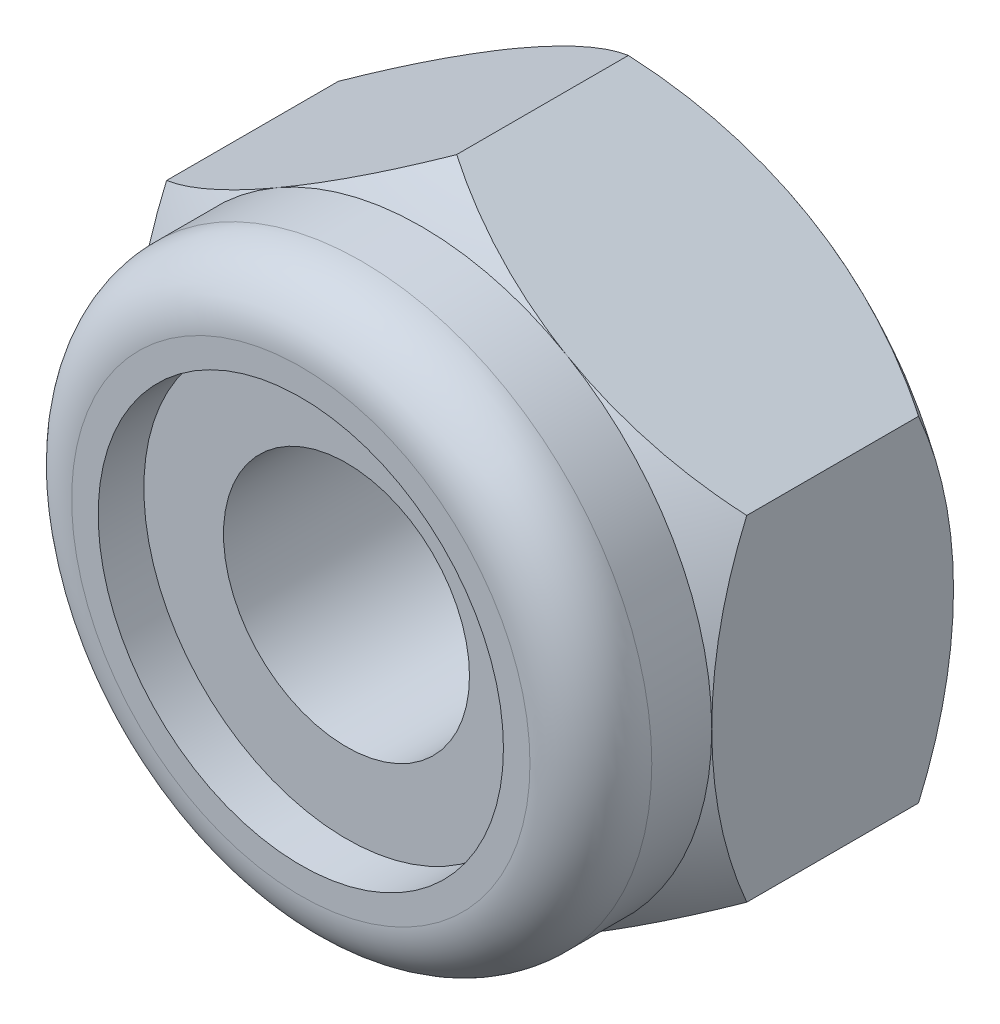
ISO-10303-21;
HEADER;
FILE_DESCRIPTION(('STEP AP214'),'2;1');
FILE_NAME('part.step','',(''),(''),'','','');
FILE_SCHEMA(('AUTOMOTIVE_DESIGN { 1 0 10303 214 1 1 1 1 }'));
ENDSEC;
DATA;
#1=APPLICATION_CONTEXT('core data for automotive mechanical design processes');
#2=APPLICATION_PROTOCOL_DEFINITION('international standard','automotive_design',2000,#1);
#3=PRODUCT_CONTEXT('',#1,'mechanical');
#4=PRODUCT('Part','Part','',(#3));
#5=PRODUCT_RELATED_PRODUCT_CATEGORY('part','',(#4));
#6=PRODUCT_DEFINITION_FORMATION('','',#4);
#7=PRODUCT_DEFINITION_CONTEXT('part definition',#1,'design');
#8=PRODUCT_DEFINITION('design','',#6,#7);
#9=PRODUCT_DEFINITION_SHAPE('','',#8);
#10=(LENGTH_UNIT() NAMED_UNIT(*) SI_UNIT(.MILLI.,.METRE.));
#11=(NAMED_UNIT(*) PLANE_ANGLE_UNIT() SI_UNIT($,.RADIAN.));
#12=(NAMED_UNIT(*) SI_UNIT($,.STERADIAN.) SOLID_ANGLE_UNIT());
#13=UNCERTAINTY_MEASURE_WITH_UNIT(LENGTH_MEASURE(1.E-05),#10,'distance_accuracy_value','');
#14=(GEOMETRIC_REPRESENTATION_CONTEXT(3) GLOBAL_UNCERTAINTY_ASSIGNED_CONTEXT((#13)) GLOBAL_UNIT_ASSIGNED_CONTEXT((#10,
#11,#12)) REPRESENTATION_CONTEXT('',''));
#15=CARTESIAN_POINT('',(0.,0.,0.));
#16=DIRECTION('',(0.,0.,1.));
#17=DIRECTION('',(1.,0.,0.));
#18=AXIS2_PLACEMENT_3D('',#15,#16,#17);
#19=CARTESIAN_POINT('',(0.,0.,0.));
#20=DIRECTION('',(0.,0.,-1.));
#21=DIRECTION('',(0.,-1.,0.));
#22=AXIS2_PLACEMENT_3D('',#19,#20,#21);
#23=PLANE('',#22);
#24=CARTESIAN_POINT('',(0.,0.,0.));
#25=DIRECTION('',(0.,0.,-1.));
#26=DIRECTION('',(-1.,0.,0.));
#27=AXIS2_PLACEMENT_3D('',#24,#25,#26);
#28=CIRCLE('',#27,2.0193);
#29=CARTESIAN_POINT('',(-2.0193,0.,0.));
#30=VERTEX_POINT('',#29);
#31=EDGE_CURVE('E421',#30,#30,#28,.T.);
#32=ORIENTED_EDGE('',*,*,#31,.F.);
#33=EDGE_LOOP('',(#32));
#34=FACE_BOUND('',#33,.T.);
#35=CARTESIAN_POINT('',(4.7625,0.,0.));
#36=CARTESIAN_POINT('',(4.7625,-0.624642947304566,0.));
#37=CARTESIAN_POINT('',(4.59902480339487,-1.23403091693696,0.));
#38=CARTESIAN_POINT('',(4.43639139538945,-1.84028094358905,0.));
#39=CARTESIAN_POINT('',(4.12508997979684,-2.38013422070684,0.));
#40=CARTESIAN_POINT('',(3.81414250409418,-2.91937370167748,0.));
#41=CARTESIAN_POINT('',(3.36998967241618,-3.36434937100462,0.));
#42=CARTESIAN_POINT('',(2.92417940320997,-3.81098554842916,0.));
#43=CARTESIAN_POINT('',(2.38125,-4.12444598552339,0.));
#44=B_SPLINE_CURVE_WITH_KNOTS('',2,(#35,#36,#37,#38,#39,#40,#41,#42,#43),.UNSPECIFIED.,.F.,.F.,
(3,2,2,2,3),(0.,0.25,0.5,0.75,1.),.UNSPECIFIED.);
#45=CARTESIAN_POINT('',(4.7625,0.,0.));
#46=VERTEX_POINT('',#45);
#47=CARTESIAN_POINT('',(2.38125,-4.12444598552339,0.));
#48=VERTEX_POINT('',#47);
#49=EDGE_CURVE('E28',#46,#48,#44,.T.);
#50=ORIENTED_EDGE('',*,*,#49,.T.);
#51=CARTESIAN_POINT('',(2.38125,-4.12444598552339,0.));
#52=CARTESIAN_POINT('',(1.84032377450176,-4.43674988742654,0.));
#53=CARTESIAN_POINT('',(1.23062409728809,-4.59988727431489,0.));
#54=CARTESIAN_POINT('',(0.624362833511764,-4.76210464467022,0.));
#55=CARTESIAN_POINT('',(0.00116867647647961,-4.76249985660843,0.));
#56=CARTESIAN_POINT('',(-0.621229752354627,-4.76289456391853,0.));
#57=CARTESIAN_POINT('',(-1.2283462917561,-4.60084780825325,0.));
#58=CARTESIAN_POINT('',(-1.83789584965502,-4.43815165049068,0.));
#59=CARTESIAN_POINT('',(-2.38125000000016,-4.12444598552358,0.));
#60=B_SPLINE_CURVE_WITH_KNOTS('',2,(#51,#52,#53,#54,#55,#56,#57,#58,#59),.UNSPECIFIED.,.F.,.F.,
(3,2,2,2,3),(0.,0.25,0.5,0.75,1.),.UNSPECIFIED.);
#61=CARTESIAN_POINT('',(-2.38125,-4.12444598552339,0.));
#62=VERTEX_POINT('',#61);
#63=EDGE_CURVE('E11',#48,#62,#60,.T.);
#64=ORIENTED_EDGE('',*,*,#63,.T.);
#65=CARTESIAN_POINT('',(-2.38125,-4.12444598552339,0.));
#66=CARTESIAN_POINT('',(-2.92220666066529,-3.81212451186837,0.));
#67=CARTESIAN_POINT('',(-3.36821452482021,-3.3658568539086,0.));
#68=CARTESIAN_POINT('',(-3.81192574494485,-2.92188717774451,0.));
#69=CARTESIAN_POINT('',(-4.12380168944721,-2.38236560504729,0.));
#70=CARTESIAN_POINT('',(-4.43532304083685,-1.84345745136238,0.));
#71=CARTESIAN_POINT('',(-4.59860685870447,-1.23632198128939,0.));
#72=CARTESIAN_POINT('',(-4.76250000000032,-0.626920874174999,0.));
#73=CARTESIAN_POINT('',(-4.76250000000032,0.,0.));
#74=B_SPLINE_CURVE_WITH_KNOTS('',2,(#65,#66,#67,#68,#69,#70,#71,#72,#73),.UNSPECIFIED.,.F.,.F.,
(3,2,2,2,3),(0.,0.25,0.5,0.75,1.),.UNSPECIFIED.);
#75=CARTESIAN_POINT('',(-4.7625,0.,0.));
#76=VERTEX_POINT('',#75);
#77=EDGE_CURVE('E551',#62,#76,#74,.T.);
#78=ORIENTED_EDGE('',*,*,#77,.T.);
#79=CARTESIAN_POINT('',(-4.7625,0.,0.));
#80=CARTESIAN_POINT('',(-4.7625,0.62464294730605,0.));
#81=CARTESIAN_POINT('',(-4.59902480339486,1.23403091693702,0.));
#82=CARTESIAN_POINT('',(-4.43639139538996,1.84028094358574,0.));
#83=CARTESIAN_POINT('',(-4.12508997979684,2.38013422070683,0.));
#84=CARTESIAN_POINT('',(-3.81414250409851,2.91937370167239,0.));
#85=CARTESIAN_POINT('',(-3.36998967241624,3.36434937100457,0.));
#86=CARTESIAN_POINT('',(-2.92417940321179,3.81098554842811,0.));
#87=CARTESIAN_POINT('',(-2.38125,4.12444598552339,0.));
#88=B_SPLINE_CURVE_WITH_KNOTS('',2,(#79,#80,#81,#82,#83,#84,#85,#86,#87),.UNSPECIFIED.,.F.,.F.,
(3,2,2,2,3),(0.,0.25,0.5,0.75,1.),.UNSPECIFIED.);
#89=CARTESIAN_POINT('',(-2.38125,4.12444598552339,0.));
#90=VERTEX_POINT('',#89);
#91=EDGE_CURVE('E562',#76,#90,#88,.T.);
#92=ORIENTED_EDGE('',*,*,#91,.T.);
#93=CARTESIAN_POINT('',(-2.38125,4.12444598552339,0.));
#94=CARTESIAN_POINT('',(-1.84032377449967,4.43674988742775,0.));
#95=CARTESIAN_POINT('',(-1.23062409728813,4.59988727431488,0.));
#96=CARTESIAN_POINT('',(-0.624362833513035,4.76210464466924,0.));
#97=CARTESIAN_POINT('',(-0.00116867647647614,4.76249985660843,0.));
#98=CARTESIAN_POINT('',(0.621229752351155,4.7628945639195,0.));
#99=CARTESIAN_POINT('',(1.22834629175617,4.60084780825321,0.));
#100=CARTESIAN_POINT('',(1.83789584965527,4.43815165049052,0.));
#101=CARTESIAN_POINT('',(2.38125000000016,4.12444598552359,0.));
#102=B_SPLINE_CURVE_WITH_KNOTS('',2,(#93,#94,#95,#96,#97,#98,#99,#100,#101),.UNSPECIFIED.,.F.,
.F.,(3,2,2,2,3),(0.,0.25,0.5,0.75,1.),.UNSPECIFIED.);
#103=CARTESIAN_POINT('',(2.38125,4.12444598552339,0.));
#104=VERTEX_POINT('',#103);
#105=EDGE_CURVE('E99',#90,#104,#102,.T.);
#106=ORIENTED_EDGE('',*,*,#105,.T.);
#107=CARTESIAN_POINT('',(2.38125,4.12444598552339,0.));
#108=CARTESIAN_POINT('',(2.9222066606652,3.81212451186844,0.));
#109=CARTESIAN_POINT('',(3.36821452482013,3.36585685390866,0.));
#110=CARTESIAN_POINT('',(3.81192574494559,2.92188717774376,0.));
#111=CARTESIAN_POINT('',(4.1238016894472,2.38236560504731,0.));
#112=CARTESIAN_POINT('',(4.43532304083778,1.84345745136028,0.));
#113=CARTESIAN_POINT('',(4.59860685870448,1.23632198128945,0.));
#114=CARTESIAN_POINT('',(4.76250000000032,0.626920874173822,0.));
#115=CARTESIAN_POINT('',(4.76250000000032,0.,0.));
#116=B_SPLINE_CURVE_WITH_KNOTS('',2,(#107,#108,#109,#110,#111,#112,#113,#114,#115),
.UNSPECIFIED.,.F.,.F.,(3,2,2,2,3),(0.,0.25,0.5,0.75,1.),.UNSPECIFIED.);
#117=EDGE_CURVE('E91',#104,#46,#116,.T.);
#118=ORIENTED_EDGE('',*,*,#117,.T.);
#119=EDGE_LOOP('',(#50,#64,#78,#92,#106,#118));
#120=FACE_BOUND('',#119,.T.);
#121=ADVANCED_FACE('F17',(#34,#120),#23,.T.);
#122=CARTESIAN_POINT('',(0.,0.,6.86537617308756));
#123=DIRECTION('',(1.,0.,0.));
#124=DIRECTION('',(0.,-0.658959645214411,-0.752178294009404));
#125=AXIS2_PLACEMENT_3D('',#122,#123,#124);
#126=SPHERICAL_SURFACE('',#125,8.35552489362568);
#127=CARTESIAN_POINT('',(2.38125,-4.12444598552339,0.));
#128=CARTESIAN_POINT('',(2.27355967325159,-4.18662015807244,-4.05013132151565E-06));
#129=CARTESIAN_POINT('',(2.16586692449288,-4.24878960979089,0.00337361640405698));
#130=CARTESIAN_POINT('',(1.95247355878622,-4.37197443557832,0.0167664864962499));
#131=CARTESIAN_POINT('',(1.84676805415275,-4.43299269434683,0.0266774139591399));
#132=CARTESIAN_POINT('',(1.63759855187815,-4.5537390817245,0.0528101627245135));
#133=CARTESIAN_POINT('',(1.53412516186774,-4.61347257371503,0.0689320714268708));
#134=CARTESIAN_POINT('',(1.3296398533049,-4.73152470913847,0.107150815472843));
#135=CARTESIAN_POINT('',(1.22861451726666,-4.7898510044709,0.129152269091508));
#136=CARTESIAN_POINT('',(1.02921818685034,-4.90497689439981,0.178795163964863));
#137=CARTESIAN_POINT('',(0.930830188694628,-4.96178621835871,0.206345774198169));
#138=CARTESIAN_POINT('',(0.736875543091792,-5.07377916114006,0.266753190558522));
#139=CARTESIAN_POINT('',(0.641288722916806,-5.12897437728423,0.299523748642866));
#140=CARTESIAN_POINT('',(0.453079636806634,-5.23765283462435,0.370042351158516));
#141=CARTESIAN_POINT('',(0.360434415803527,-5.29114933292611,0.407708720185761));
#142=CARTESIAN_POINT('',(0.178228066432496,-5.39635762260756,0.487693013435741));
#143=CARTESIAN_POINT('',(0.088641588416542,-5.44808410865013,0.529933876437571));
#144=CARTESIAN_POINT('',(9.57020920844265E-11,-5.49926131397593,0.574675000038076));
#145=B_SPLINE_CURVE_WITH_KNOTS('',3,(#127,#128,#129,#130,#131,#132,#133,#134,#135,#136,#137,
#138,#139,#140,#141,#142,#143,#144),.UNSPECIFIED.,.F.,.F.,(4,2,2,2,2,2,2,2,4),(0.,
0.373002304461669,0.740190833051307,1.10170388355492,1.45767508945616,1.80823440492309,
2.15350926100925,2.49362587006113,2.82871065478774),.UNSPECIFIED.);
#146=CARTESIAN_POINT('',(6.21868092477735E-11,-5.49926131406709,0.574675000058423));
#147=VERTEX_POINT('',#146);
#148=EDGE_CURVE('E554',#48,#147,#145,.T.);
#149=ORIENTED_EDGE('',*,*,#148,.T.);
#150=CARTESIAN_POINT('',(3.88048967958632E-11,-5.49926131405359,0.574675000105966));
#151=CARTESIAN_POINT('',(-0.0886415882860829,-5.44808410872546,0.529933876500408));
#152=CARTESIAN_POINT('',(-0.178228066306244,-5.39635762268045,0.48769301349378));
#153=CARTESIAN_POINT('',(-0.360434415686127,-5.29114933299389,0.407708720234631));
#154=CARTESIAN_POINT('',(-0.453079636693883,-5.23765283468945,0.370042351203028));
#155=CARTESIAN_POINT('',(-0.641288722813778,-5.12897437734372,0.29952374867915));
#156=CARTESIAN_POINT('',(-0.736875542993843,-5.07377916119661,0.266753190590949));
#157=CARTESIAN_POINT('',(-0.930830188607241,-4.96178621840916,0.206345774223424));
#158=CARTESIAN_POINT('',(-1.02921818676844,-4.90497689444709,0.178795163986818));
#159=CARTESIAN_POINT('',(-1.22861451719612,-4.78985100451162,0.129152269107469));
#160=CARTESIAN_POINT('',(-1.32963985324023,-4.7315247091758,0.107150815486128));
#161=CARTESIAN_POINT('',(-1.53412516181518,-4.61347257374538,0.0689320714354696));
#162=CARTESIAN_POINT('',(-1.63759855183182,-4.55373908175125,0.0528101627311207));
#163=CARTESIAN_POINT('',(-1.84676805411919,-4.43299269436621,0.0266774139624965));
#164=CARTESIAN_POINT('',(-1.95247355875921,-4.37197443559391,0.0167664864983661));
#165=CARTESIAN_POINT('',(-2.16586692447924,-4.24878960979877,0.00337361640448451));
#166=CARTESIAN_POINT('',(-2.27355967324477,-4.18662015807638,-4.05013132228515E-06));
#167=CARTESIAN_POINT('',(-2.38125,-4.12444598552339,0.));
#168=B_SPLINE_CURVE_WITH_KNOTS('',3,(#150,#151,#152,#153,#154,#155,#156,#157,#158,#159,#160,
#161,#162,#163,#164,#165,#166,#167),.UNSPECIFIED.,.F.,.F.,(4,2,2,2,2,2,2,2,4),(0.,
0.33508478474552,0.675201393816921,1.02047624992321,1.37103556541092,1.72700677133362,
2.08851982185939,2.4557083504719,2.82871065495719),.UNSPECIFIED.);
#169=EDGE_CURVE('E518',#147,#62,#168,.T.);
#170=ORIENTED_EDGE('',*,*,#169,.T.);
#171=ORIENTED_EDGE('',*,*,#63,.F.);
#172=EDGE_LOOP('',(#149,#170,#171));
#173=FACE_BOUND('',#172,.T.);
#174=ADVANCED_FACE('F144',(#173),#126,.T.);
#175=CARTESIAN_POINT('',(0.,0.,6.8653761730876));
#176=DIRECTION('',(1.,0.,0.));
#177=DIRECTION('',(0.,-0.517754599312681,-0.855529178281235));
#178=AXIS2_PLACEMENT_3D('',#175,#176,#177);
#179=SPHERICAL_SURFACE('',#178,8.3555248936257);
#180=CARTESIAN_POINT('',(4.7625,0.,6.86537617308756));
#181=DIRECTION('',(-1.,0.,0.));
#182=DIRECTION('',(0.,0.,-1.));
#183=AXIS2_PLACEMENT_3D('',#180,#181,#182);
#184=CIRCLE('',#183,6.86537617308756);
#185=CARTESIAN_POINT('',(4.76249999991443,-2.7496306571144,0.57467500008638));
#186=VERTEX_POINT('',#185);
#187=EDGE_CURVE('E84',#46,#186,#184,.T.);
#188=ORIENTED_EDGE('',*,*,#187,.T.);
#189=CARTESIAN_POINT('',(4.76249999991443,-2.749630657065,0.574675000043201));
#190=CARTESIAN_POINT('',(4.66679066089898,-2.80488579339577,0.52636460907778));
#191=CARTESIAN_POINT('',(4.56996799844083,-2.86074876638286,0.480952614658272));
#192=CARTESIAN_POINT('',(4.37510438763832,-2.97315021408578,0.396376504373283));
#193=CARTESIAN_POINT('',(4.27707780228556,-3.029680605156,0.357168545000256));
#194=CARTESIAN_POINT('',(4.08007649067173,-3.14330206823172,0.28498407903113));
#195=CARTESIAN_POINT('',(3.98111316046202,-3.20038647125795,0.25196598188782));
#196=CARTESIAN_POINT('',(3.78249814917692,-3.31498672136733,0.192122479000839));
#197=CARTESIAN_POINT('',(3.68285521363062,-3.37249729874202,0.16525795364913));
#198=CARTESIAN_POINT('',(3.48312845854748,-3.48781333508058,0.117669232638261));
#199=CARTESIAN_POINT('',(3.38305106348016,-3.54561483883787,0.0969084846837));
#200=CARTESIAN_POINT('',(3.1826905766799,-3.66136802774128,0.0614593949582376));
#201=CARTESIAN_POINT('',(3.08241190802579,-3.71931697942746,0.0467371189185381));
#202=CARTESIAN_POINT('',(2.88187224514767,-3.83521444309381,0.0232848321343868));
#203=CARTESIAN_POINT('',(2.78161397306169,-3.89316133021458,0.0145234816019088));
#204=CARTESIAN_POINT('',(2.58132395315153,-4.00889618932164,0.00289342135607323));
#205=CARTESIAN_POINT('',(2.48129351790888,-4.06668354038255,-4.06951372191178E-06));
#206=CARTESIAN_POINT('',(2.38125,-4.12444598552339,0.));
#207=B_SPLINE_CURVE_WITH_KNOTS('',3,(#189,#190,#191,#192,#193,#194,#195,#196,#197,#198,#199,
#200,#201,#202,#203,#204,#205,#206),.UNSPECIFIED.,.F.,.F.,(4,2,2,2,2,2,2,2,4),(0.,
0.361796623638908,0.72090972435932,1.07751588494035,1.43178788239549,1.78389297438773,
2.13399130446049,2.4822344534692,2.82876415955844),.UNSPECIFIED.);
#208=EDGE_CURVE('E86',#186,#48,#207,.T.);
#209=ORIENTED_EDGE('',*,*,#208,.T.);
#210=ORIENTED_EDGE('',*,*,#49,.F.);
#211=EDGE_LOOP('',(#188,#209,#210));
#212=FACE_BOUND('',#211,.T.);
#213=ADVANCED_FACE('F82',(#212),#179,.T.);
#214=CARTESIAN_POINT('',(0.,0.,6.86537617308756));
#215=DIRECTION('',(1.,0.,0.));
#216=DIRECTION('',(0.,-0.00324586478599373,-0.999994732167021));
#217=AXIS2_PLACEMENT_3D('',#214,#215,#216);
#218=SPHERICAL_SURFACE('',#217,8.35552489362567);
#219=CARTESIAN_POINT('',(2.38125,4.12444598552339,0.));
#220=CARTESIAN_POINT('',(2.48129351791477,4.06668354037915,-4.06951372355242E-06));
#221=CARTESIAN_POINT('',(2.58132395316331,4.00889618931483,0.00289342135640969));
#222=CARTESIAN_POINT('',(2.78161397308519,3.89316133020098,0.014523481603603));
#223=CARTESIAN_POINT('',(2.88187224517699,3.83521444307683,0.0232848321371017));
#224=CARTESIAN_POINT('',(3.08241190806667,3.71931697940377,0.0467371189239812));
#225=CARTESIAN_POINT('',(3.18269057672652,3.66136802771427,0.0614593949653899));
#226=CARTESIAN_POINT('',(3.38305106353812,3.54561483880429,0.0969084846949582));
#227=CARTESIAN_POINT('',(3.48312845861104,3.48781333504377,0.117669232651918));
#228=CARTESIAN_POINT('',(3.68285521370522,3.37249729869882,0.165257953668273));
#229=CARTESIAN_POINT('',(3.78249814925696,3.314986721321,0.192122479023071));
#230=CARTESIAN_POINT('',(3.98111316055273,3.20038647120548,0.251965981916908));
#231=CARTESIAN_POINT('',(4.08007649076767,3.14330206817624,0.284984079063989));
#232=CARTESIAN_POINT('',(4.27707780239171,3.02968060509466,0.35716854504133));
#233=CARTESIAN_POINT('',(4.37510438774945,2.97315021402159,0.396376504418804));
#234=CARTESIAN_POINT('',(4.56996799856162,2.86074876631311,0.480952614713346));
#235=CARTESIAN_POINT('',(4.66679066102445,2.80488579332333,0.526364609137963));
#236=CARTESIAN_POINT('',(4.76250000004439,2.74963065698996,0.574675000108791));
#237=B_SPLINE_CURVE_WITH_KNOTS('',3,(#219,#220,#221,#222,#223,#224,#225,#226,#227,#228,#229,
#230,#231,#232,#233,#234,#235,#236),.UNSPECIFIED.,.F.,.F.,(4,2,2,2,2,2,2,2,4),(0.,
0.34652970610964,0.694772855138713,1.04487118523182,1.39697627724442,1.75124827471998,
2.1078544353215,2.46696753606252,2.82876415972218),.UNSPECIFIED.);
#238=CARTESIAN_POINT('',(4.7625,2.74963065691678,0.574675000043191));
#239=VERTEX_POINT('',#238);
#240=EDGE_CURVE('E111',#104,#239,#237,.T.);
#241=ORIENTED_EDGE('',*,*,#240,.T.);
#242=CARTESIAN_POINT('',(4.7625,0.,6.86537617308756));
#243=DIRECTION('',(-1.,0.,0.));
#244=DIRECTION('',(0.,0.,-1.));
#245=AXIS2_PLACEMENT_3D('',#242,#243,#244);
#246=CIRCLE('',#245,6.86537617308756);
#247=EDGE_CURVE('E108',#239,#46,#246,.T.);
#248=ORIENTED_EDGE('',*,*,#247,.T.);
#249=ORIENTED_EDGE('',*,*,#117,.F.);
#250=EDGE_LOOP('',(#241,#248,#249));
#251=FACE_BOUND('',#250,.T.);
#252=ADVANCED_FACE('F109',(#251),#218,.T.);
#253=CARTESIAN_POINT('',(0.,0.,6.86537617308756));
#254=DIRECTION('',(1.,0.,0.));
#255=DIRECTION('',(0.,0.51406228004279,-0.857752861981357));
#256=AXIS2_PLACEMENT_3D('',#253,#254,#255);
#257=SPHERICAL_SURFACE('',#256,8.35552489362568);
#258=CARTESIAN_POINT('',(-2.38125,4.12444598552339,0.));
#259=CARTESIAN_POINT('',(-2.27355967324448,4.18662015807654,-4.05013132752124E-06));
#260=CARTESIAN_POINT('',(-2.16586692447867,4.24878960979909,0.00337361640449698));
#261=CARTESIAN_POINT('',(-1.95247355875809,4.37197443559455,0.0167664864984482));
#262=CARTESIAN_POINT('',(-1.8467680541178,4.432992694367,0.0266774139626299));
#263=CARTESIAN_POINT('',(-1.6375985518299,4.55373908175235,0.0528101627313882));
#264=CARTESIAN_POINT('',(-1.534125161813,4.61347257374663,0.0689320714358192));
#265=CARTESIAN_POINT('',(-1.32963985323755,4.73152470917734,0.107150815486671));
#266=CARTESIAN_POINT('',(-1.2286145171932,4.7898510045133,0.129152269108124));
#267=CARTESIAN_POINT('',(-1.02921818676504,4.90497689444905,0.178795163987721));
#268=CARTESIAN_POINT('',(-0.93083018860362,4.96178621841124,0.206345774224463));
#269=CARTESIAN_POINT('',(-0.736875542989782,5.07377916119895,0.266753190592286));
#270=CARTESIAN_POINT('',(-0.641288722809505,5.12897437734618,0.299523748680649));
#271=CARTESIAN_POINT('',(-0.453079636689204,5.23765283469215,0.37004235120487));
#272=CARTESIAN_POINT('',(-0.360434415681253,5.2911493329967,0.407708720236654));
#273=CARTESIAN_POINT('',(-0.178228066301,5.39635762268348,0.487693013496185));
#274=CARTESIAN_POINT('',(-0.0886415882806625,5.44808410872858,0.529933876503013));
#275=CARTESIAN_POINT('',(4.43950431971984E-11,5.49926131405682,0.574675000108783));
#276=B_SPLINE_CURVE_WITH_KNOTS('',3,(#258,#259,#260,#261,#262,#263,#264,#265,#266,#267,#268,
#269,#270,#271,#272,#273,#274,#275),.UNSPECIFIED.,.F.,.F.,(4,2,2,2,2,2,2,2,4),(0.,
0.373002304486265,0.740190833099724,1.10170388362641,1.45767508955,1.80823440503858,
2.15350926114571,2.49362587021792,2.82871065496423),.UNSPECIFIED.);
#277=CARTESIAN_POINT('',(1.31235572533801E-10,5.49926131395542,0.574675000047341));
#278=VERTEX_POINT('',#277);
#279=EDGE_CURVE('E531',#90,#278,#276,.T.);
#280=ORIENTED_EDGE('',*,*,#279,.T.);
#281=CARTESIAN_POINT('',(9.13288542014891E-11,5.49926131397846,0.574675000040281));
#282=CARTESIAN_POINT('',(0.0886415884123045,5.44808410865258,0.529933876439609));
#283=CARTESIAN_POINT('',(0.178228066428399,5.39635762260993,0.487693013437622));
#284=CARTESIAN_POINT('',(0.360434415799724,5.29114933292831,0.407708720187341));
#285=CARTESIAN_POINT('',(0.453079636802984,5.23765283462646,0.370042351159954));
#286=CARTESIAN_POINT('',(0.641288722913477,5.12897437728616,0.299523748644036));
#287=CARTESIAN_POINT('',(0.73687554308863,5.07377916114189,0.266753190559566));
#288=CARTESIAN_POINT('',(0.930830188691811,4.96178621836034,0.206345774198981));
#289=CARTESIAN_POINT('',(1.0292181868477,4.90497689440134,0.178795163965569));
#290=CARTESIAN_POINT('',(1.22861451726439,4.78985100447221,0.129152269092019));
#291=CARTESIAN_POINT('',(1.32963985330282,4.73152470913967,0.107150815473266));
#292=CARTESIAN_POINT('',(1.53412516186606,4.61347257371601,0.0689320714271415));
#293=CARTESIAN_POINT('',(1.63759855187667,4.55373908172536,0.0528101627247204));
#294=CARTESIAN_POINT('',(1.84676805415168,4.43299269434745,0.0266774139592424));
#295=CARTESIAN_POINT('',(1.95247355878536,4.37197443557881,0.0167664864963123));
#296=CARTESIAN_POINT('',(2.16586692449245,4.24878960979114,0.00337361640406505));
#297=CARTESIAN_POINT('',(2.27355967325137,4.18662015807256,-4.05013132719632E-06));
#298=CARTESIAN_POINT('',(2.38125,4.12444598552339,0.));
#299=B_SPLINE_CURVE_WITH_KNOTS('',3,(#281,#282,#283,#284,#285,#286,#287,#288,#289,#290,#291,
#292,#293,#294,#295,#296,#297,#298),.UNSPECIFIED.,.F.,.F.,(4,2,2,2,2,2,2,2,4),(0.,
0.335084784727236,0.67520139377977,1.02047624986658,1.37103556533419,1.72700677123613,
2.08851982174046,2.45570835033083,2.82871065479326),.UNSPECIFIED.);
#300=EDGE_CURVE('E129',#278,#104,#299,.T.);
#301=ORIENTED_EDGE('',*,*,#300,.T.);
#302=ORIENTED_EDGE('',*,*,#105,.F.);
#303=EDGE_LOOP('',(#280,#301,#302));
#304=FACE_BOUND('',#303,.T.);
#305=ADVANCED_FACE('F145',(#304),#257,.T.);
#306=CARTESIAN_POINT('',(0.,0.,6.86537617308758));
#307=DIRECTION('',(1.,0.,0.));
#308=DIRECTION('',(0.,-0.00324586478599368,-0.999994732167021));
#309=AXIS2_PLACEMENT_3D('',#306,#307,#308);
#310=SPHERICAL_SURFACE('',#309,8.3555248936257);
#311=CARTESIAN_POINT('',(-4.7625,0.,6.86537617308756));
#312=DIRECTION('',(1.,0.,0.));
#313=DIRECTION('',(0.,0.,-1.));
#314=AXIS2_PLACEMENT_3D('',#311,#312,#313);
#315=CIRCLE('',#314,6.86537617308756);
#316=CARTESIAN_POINT('',(-4.76249999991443,2.7496306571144,0.574675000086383));
#317=VERTEX_POINT('',#316);
#318=EDGE_CURVE('E513',#76,#317,#315,.T.);
#319=ORIENTED_EDGE('',*,*,#318,.T.);
#320=CARTESIAN_POINT('',(-4.76249999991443,2.749630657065,0.574675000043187));
#321=CARTESIAN_POINT('',(-4.66679066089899,2.80488579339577,0.526364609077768));
#322=CARTESIAN_POINT('',(-4.56996799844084,2.86074876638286,0.480952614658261));
#323=CARTESIAN_POINT('',(-4.37510438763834,2.97315021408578,0.396376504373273));
#324=CARTESIAN_POINT('',(-4.27707780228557,3.02968060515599,0.357168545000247));
#325=CARTESIAN_POINT('',(-4.08007649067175,3.14330206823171,0.284984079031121));
#326=CARTESIAN_POINT('',(-3.98111316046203,3.20038647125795,0.251965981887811));
#327=CARTESIAN_POINT('',(-3.78249814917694,3.31498672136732,0.19212247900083));
#328=CARTESIAN_POINT('',(-3.68285521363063,3.37249729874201,0.165257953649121));
#329=CARTESIAN_POINT('',(-3.4831284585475,3.48781333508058,0.117669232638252));
#330=CARTESIAN_POINT('',(-3.38305106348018,3.54561483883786,0.0969084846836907));
#331=CARTESIAN_POINT('',(-3.18269057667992,3.66136802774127,0.0614593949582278));
#332=CARTESIAN_POINT('',(-3.08241190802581,3.71931697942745,0.0467371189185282));
#333=CARTESIAN_POINT('',(-2.88187224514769,3.83521444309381,0.0232848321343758));
#334=CARTESIAN_POINT('',(-2.78161397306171,3.89316133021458,0.0145234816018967));
#335=CARTESIAN_POINT('',(-2.58132395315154,4.00889618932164,0.00289342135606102));
#336=CARTESIAN_POINT('',(-2.48129351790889,4.06668354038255,-4.0695137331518E-06));
#337=CARTESIAN_POINT('',(-2.38125,4.12444598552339,0.));
#338=B_SPLINE_CURVE_WITH_KNOTS('',3,(#320,#321,#322,#323,#324,#325,#326,#327,#328,#329,#330,
#331,#332,#333,#334,#335,#336,#337),.UNSPECIFIED.,.F.,.F.,(4,2,2,2,2,2,2,2,4),(0.,
0.3617966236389,0.720909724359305,1.07751588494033,1.43178788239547,1.78389297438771,
2.13399130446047,2.48223445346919,2.82876415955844),.UNSPECIFIED.);
#339=EDGE_CURVE('E535',#317,#90,#338,.T.);
#340=ORIENTED_EDGE('',*,*,#339,.T.);
#341=ORIENTED_EDGE('',*,*,#91,.F.);
#342=EDGE_LOOP('',(#319,#340,#341));
#343=FACE_BOUND('',#342,.T.);
#344=ADVANCED_FACE('F177',(#343),#310,.T.);
#345=CARTESIAN_POINT('',(0.,0.,6.86537617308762));
#346=DIRECTION('',(1.,0.,0.));
#347=DIRECTION('',(0.,-0.517754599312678,-0.855529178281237));
#348=AXIS2_PLACEMENT_3D('',#345,#346,#347);
#349=SPHERICAL_SURFACE('',#348,8.35552489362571);
#350=CARTESIAN_POINT('',(-4.7625,0.,6.86537617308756));
#351=DIRECTION('',(1.,0.,0.));
#352=DIRECTION('',(0.,0.,-1.));
#353=AXIS2_PLACEMENT_3D('',#350,#351,#352);
#354=CIRCLE('',#353,6.86537617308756);
#355=CARTESIAN_POINT('',(-4.76250000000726,-2.74963065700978,0.574675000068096));
#356=VERTEX_POINT('',#355);
#357=EDGE_CURVE('E522',#356,#76,#354,.T.);
#358=ORIENTED_EDGE('',*,*,#357,.T.);
#359=ORIENTED_EDGE('',*,*,#77,.F.);
#360=CARTESIAN_POINT('',(-2.38125,-4.12444598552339,0.));
#361=CARTESIAN_POINT('',(-2.48129351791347,-4.0666835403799,-4.06951372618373E-06));
#362=CARTESIAN_POINT('',(-2.58132395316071,-4.00889618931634,0.00289342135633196));
#363=CARTESIAN_POINT('',(-2.78161397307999,-3.89316133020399,0.014523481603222));
#364=CARTESIAN_POINT('',(-2.8818722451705,-3.83521444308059,0.0232848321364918));
#365=CARTESIAN_POINT('',(-3.0824119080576,-3.71931697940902,0.0467371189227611));
#366=CARTESIAN_POINT('',(-3.18269057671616,-3.66136802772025,0.0614593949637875));
#367=CARTESIAN_POINT('',(-3.38305106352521,-3.54561483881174,0.0969084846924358));
#368=CARTESIAN_POINT('',(-3.48312845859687,-3.48781333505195,0.117669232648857));
#369=CARTESIAN_POINT('',(-3.68285521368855,-3.37249729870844,0.165257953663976));
#370=CARTESIAN_POINT('',(-3.78249814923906,-3.31498672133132,0.192122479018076));
#371=CARTESIAN_POINT('',(-3.98111316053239,-3.2003864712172,0.251965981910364));
#372=CARTESIAN_POINT('',(-4.08007649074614,-3.14330206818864,0.284984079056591));
#373=CARTESIAN_POINT('',(-4.27707780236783,-3.0296806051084,0.357168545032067));
#374=CARTESIAN_POINT('',(-4.37510438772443,-2.97315021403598,0.396376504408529));
#375=CARTESIAN_POINT('',(-4.56996799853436,-2.86074876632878,0.480952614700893));
#376=CARTESIAN_POINT('',(-4.66679066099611,-2.80488579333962,0.526364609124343));
#377=CARTESIAN_POINT('',(-4.76250000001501,-2.74963065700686,0.574675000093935));
#378=B_SPLINE_CURVE_WITH_KNOTS('',3,(#360,#361,#362,#363,#364,#365,#366,#367,#368,#369,#370,
#371,#372,#373,#374,#375,#376,#377),.UNSPECIFIED.,.F.,.F.,(4,2,2,2,2,2,2,2,4),(0.,
0.346529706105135,0.694772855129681,1.04487118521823,1.39697627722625,1.75124827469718,
2.10785443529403,2.46696753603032,2.82876415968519),.UNSPECIFIED.);
#379=EDGE_CURVE('E514',#62,#356,#378,.T.);
#380=ORIENTED_EDGE('',*,*,#379,.T.);
#381=EDGE_LOOP('',(#358,#359,#380));
#382=FACE_BOUND('',#381,.T.);
#383=ADVANCED_FACE('F272',(#382),#349,.T.);
#384=CARTESIAN_POINT('',(-2.38125,-4.12444598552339,1.984375));
#385=DIRECTION('',(-0.5,-0.866025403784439,0.));
#386=DIRECTION('',(-0.866025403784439,0.5,0.));
#387=AXIS2_PLACEMENT_3D('',#384,#385,#386);
#388=PLANE('',#387);
#389=DIRECTION('',(0.,0.,1.));
#390=VECTOR('',#389,1.);
#391=CARTESIAN_POINT('',(8.55717406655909E-11,-5.49926131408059,1.984375));
#392=LINE('',#391,#390);
#393=CARTESIAN_POINT('',(8.64232517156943E-12,-5.49926131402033,3.39407499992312));
#394=VERTEX_POINT('',#393);
#395=EDGE_CURVE('E117',#147,#394,#392,.T.);
#396=ORIENTED_EDGE('',*,*,#395,.T.);
#397=CARTESIAN_POINT('',(-1.01646122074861E-11,-5.49926131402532,3.39407499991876));
#398=CARTESIAN_POINT('',(-0.561700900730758,-5.17496314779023,3.6775728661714));
#399=CARTESIAN_POINT('',(-1.16556714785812,-4.82632080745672,3.82328780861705));
#400=CARTESIAN_POINT('',(-1.76838595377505,-4.47828320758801,3.96875));
#401=CARTESIAN_POINT('',(-2.38125,-4.12444598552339,3.96875));
#402=B_SPLINE_CURVE_WITH_KNOTS('',2,(#397,#398,#399,#400,#401),.UNSPECIFIED.,.F.,.F.,(3,2,3),
(0.,0.5,1.),.UNSPECIFIED.);
#403=CARTESIAN_POINT('',(-2.38125,-4.12444598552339,3.96875));
#404=VERTEX_POINT('',#403);
#405=EDGE_CURVE('E301',#394,#404,#402,.T.);
#406=ORIENTED_EDGE('',*,*,#405,.T.);
#407=CARTESIAN_POINT('',(-2.38125,-4.12444598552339,3.96875));
#408=CARTESIAN_POINT('',(-2.99372194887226,-3.7708351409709,3.96875));
#409=CARTESIAN_POINT('',(-3.59720329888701,-3.42241502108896,3.823205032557));
#410=CARTESIAN_POINT('',(-4.20057295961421,-3.07405938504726,3.67768700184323));
#411=CARTESIAN_POINT('',(-4.76249999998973,-2.74963065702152,3.39407499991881));
#412=B_SPLINE_CURVE_WITH_KNOTS('',2,(#407,#408,#409,#410,#411),.UNSPECIFIED.,.F.,.F.,(3,2,3),
(0.,0.5,1.),.UNSPECIFIED.);
#413=CARTESIAN_POINT('',(-4.7625,-2.7496306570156,3.39407499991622));
#414=VERTEX_POINT('',#413);
#415=EDGE_CURVE('E257',#404,#414,#412,.T.);
#416=ORIENTED_EDGE('',*,*,#415,.T.);
#417=DIRECTION('',(0.,0.,-1.));
#418=VECTOR('',#417,1.);
#419=CARTESIAN_POINT('',(-4.7625,-2.7496306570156,1.984375));
#420=LINE('',#419,#418);
#421=EDGE_CURVE('E507',#414,#356,#420,.T.);
#422=ORIENTED_EDGE('',*,*,#421,.T.);
#423=ORIENTED_EDGE('',*,*,#379,.F.);
#424=ORIENTED_EDGE('',*,*,#169,.F.);
#425=EDGE_LOOP('',(#396,#406,#416,#422,#423,#424));
#426=FACE_BOUND('',#425,.T.);
#427=ADVANCED_FACE('F174',(#426),#388,.T.);
#428=CARTESIAN_POINT('',(2.38125,-4.12444598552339,1.984375));
#429=DIRECTION('',(0.5,-0.866025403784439,0.));
#430=DIRECTION('',(0.,0.,-1.));
#431=AXIS2_PLACEMENT_3D('',#428,#429,#430);
#432=PLANE('',#431);
#433=DIRECTION('',(0.,0.,1.));
#434=VECTOR('',#433,1.);
#435=CARTESIAN_POINT('',(4.76249999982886,-2.7496306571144,1.984375));
#436=LINE('',#435,#434);
#437=CARTESIAN_POINT('',(4.7625,-2.749630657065,3.39407499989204));
#438=VERTEX_POINT('',#437);
#439=EDGE_CURVE('E122',#186,#438,#436,.T.);
#440=ORIENTED_EDGE('',*,*,#439,.T.);
#441=CARTESIAN_POINT('',(4.76249999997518,-2.74963065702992,3.39407499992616));
#442=CARTESIAN_POINT('',(4.20129579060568,-3.07364205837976,3.67732217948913));
#443=CARTESIAN_POINT('',(3.5978474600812,-3.42204311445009,3.8230495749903));
#444=CARTESIAN_POINT('',(2.99451081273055,-3.77037969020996,3.96875));
#445=CARTESIAN_POINT('',(2.38125,-4.12444598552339,3.96875));
#446=B_SPLINE_CURVE_WITH_KNOTS('',2,(#441,#442,#443,#444,#445),.UNSPECIFIED.,.F.,.F.,(3,2,3),
(0.,0.5,1.),.UNSPECIFIED.);
#447=CARTESIAN_POINT('',(2.38125,-4.12444598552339,3.96875));
#448=VERTEX_POINT('',#447);
#449=EDGE_CURVE('E496',#438,#448,#446,.T.);
#450=ORIENTED_EDGE('',*,*,#449,.T.);
#451=CARTESIAN_POINT('',(2.38125,-4.12444598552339,3.96875));
#452=CARTESIAN_POINT('',(1.76877805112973,-4.47805683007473,3.96875));
#453=CARTESIAN_POINT('',(1.16529670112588,-4.82647694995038,3.82320503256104));
#454=CARTESIAN_POINT('',(0.561927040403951,-5.17483258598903,3.67768700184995));
#455=CARTESIAN_POINT('',(2.74459274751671E-11,-5.49926131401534,3.39407499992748));
#456=B_SPLINE_CURVE_WITH_KNOTS('',2,(#451,#452,#453,#454,#455),.UNSPECIFIED.,.F.,.F.,(3,2,3),
(0.,0.5,1.),.UNSPECIFIED.);
#457=EDGE_CURVE('E206',#448,#394,#456,.T.);
#458=ORIENTED_EDGE('',*,*,#457,.T.);
#459=ORIENTED_EDGE('',*,*,#395,.F.);
#460=ORIENTED_EDGE('',*,*,#148,.F.);
#461=ORIENTED_EDGE('',*,*,#208,.F.);
#462=EDGE_LOOP('',(#440,#450,#458,#459,#460,#461));
#463=FACE_BOUND('',#462,.T.);
#464=ADVANCED_FACE('F165',(#463),#432,.T.);
#465=CARTESIAN_POINT('',(4.7625,0.,1.984375));
#466=DIRECTION('',(1.,0.,0.));
#467=DIRECTION('',(0.,1.,0.));
#468=AXIS2_PLACEMENT_3D('',#465,#466,#467);
#469=PLANE('',#468);
#470=DIRECTION('',(0.,0.,1.));
#471=VECTOR('',#470,1.);
#472=CARTESIAN_POINT('',(4.7625,2.74963065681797,1.984375));
#473=LINE('',#472,#471);
#474=CARTESIAN_POINT('',(4.76249999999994,2.74963065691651,3.39407499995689));
#475=VERTEX_POINT('',#474);
#476=EDGE_CURVE('E539',#239,#475,#473,.T.);
#477=ORIENTED_EDGE('',*,*,#476,.T.);
#478=CARTESIAN_POINT('',(4.7625,0.,-2.89662617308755));
#479=DIRECTION('',(1.,0.,0.));
#480=DIRECTION('',(0.,0.,-1.));
#481=AXIS2_PLACEMENT_3D('',#478,#479,#480);
#482=CIRCLE('',#481,6.86537617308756);
#483=CARTESIAN_POINT('',(4.7625,0.,3.96875));
#484=VERTEX_POINT('',#483);
#485=EDGE_CURVE('E433',#475,#484,#482,.T.);
#486=ORIENTED_EDGE('',*,*,#485,.T.);
#487=CARTESIAN_POINT('',(4.7625,0.,-2.89662617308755));
#488=DIRECTION('',(1.,0.,0.));
#489=DIRECTION('',(0.,0.,-1.));
#490=AXIS2_PLACEMENT_3D('',#487,#488,#489);
#491=CIRCLE('',#490,6.86537617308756);
#492=EDGE_CURVE('E437',#484,#438,#491,.T.);
#493=ORIENTED_EDGE('',*,*,#492,.T.);
#494=ORIENTED_EDGE('',*,*,#439,.F.);
#495=ORIENTED_EDGE('',*,*,#187,.F.);
#496=ORIENTED_EDGE('',*,*,#247,.F.);
#497=EDGE_LOOP('',(#477,#486,#493,#494,#495,#496));
#498=FACE_BOUND('',#497,.T.);
#499=ADVANCED_FACE('F119',(#498),#469,.T.);
#500=CARTESIAN_POINT('',(2.38125,4.12444598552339,1.984375));
#501=DIRECTION('',(0.5,0.866025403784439,0.));
#502=DIRECTION('',(0.,0.,-1.));
#503=AXIS2_PLACEMENT_3D('',#500,#501,#502);
#504=PLANE('',#503);
#505=DIRECTION('',(0.,0.,1.));
#506=VECTOR('',#505,1.);
#507=CARTESIAN_POINT('',(1.71141746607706E-10,5.49926131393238,1.984375));
#508=LINE('',#507,#506);
#509=CARTESIAN_POINT('',(-8.64191329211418E-12,5.49926131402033,3.39407499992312));
#510=VERTEX_POINT('',#509);
#511=EDGE_CURVE('E527',#278,#510,#508,.T.);
#512=ORIENTED_EDGE('',*,*,#511,.T.);
#513=CARTESIAN_POINT('',(1.01646122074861E-11,5.49926131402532,3.39407499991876));
#514=CARTESIAN_POINT('',(0.561700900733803,5.17496314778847,3.67757286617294));
#515=CARTESIAN_POINT('',(1.16556714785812,4.82632080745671,3.82328780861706));
#516=CARTESIAN_POINT('',(1.76838595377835,4.4782832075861,3.96875));
#517=CARTESIAN_POINT('',(2.38125,4.12444598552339,3.96875));
#518=B_SPLINE_CURVE_WITH_KNOTS('',2,(#513,#514,#515,#516,#517),.UNSPECIFIED.,.F.,.F.,(3,2,3),
(0.,0.5,1.),.UNSPECIFIED.);
#519=CARTESIAN_POINT('',(2.38125,4.12444598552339,3.96875));
#520=VERTEX_POINT('',#519);
#521=EDGE_CURVE('E341',#510,#520,#518,.T.);
#522=ORIENTED_EDGE('',*,*,#521,.T.);
#523=CARTESIAN_POINT('',(2.38125,4.12444598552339,3.96875));
#524=CARTESIAN_POINT('',(2.99372194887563,3.77083514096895,3.96875));
#525=CARTESIAN_POINT('',(3.59720329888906,3.42241502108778,3.82320503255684));
#526=CARTESIAN_POINT('',(4.20057295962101,3.07405938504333,3.67768700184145));
#527=CARTESIAN_POINT('',(4.76250000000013,2.74963065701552,3.39407499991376));
#528=B_SPLINE_CURVE_WITH_KNOTS('',2,(#523,#524,#525,#526,#527),.UNSPECIFIED.,.F.,.F.,(3,2,3),
(0.,0.5,1.),.UNSPECIFIED.);
#529=EDGE_CURVE('E438',#520,#475,#528,.T.);
#530=ORIENTED_EDGE('',*,*,#529,.T.);
#531=ORIENTED_EDGE('',*,*,#476,.F.);
#532=ORIENTED_EDGE('',*,*,#240,.F.);
#533=ORIENTED_EDGE('',*,*,#300,.F.);
#534=EDGE_LOOP('',(#512,#522,#530,#531,#532,#533));
#535=FACE_BOUND('',#534,.T.);
#536=ADVANCED_FACE('F367',(#535),#504,.T.);
#537=CARTESIAN_POINT('',(-2.38125,4.12444598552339,1.984375));
#538=DIRECTION('',(-0.5,0.866025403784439,0.));
#539=DIRECTION('',(0.,0.,1.));
#540=AXIS2_PLACEMENT_3D('',#537,#538,#539);
#541=PLANE('',#540);
#542=DIRECTION('',(0.,0.,1.));
#543=VECTOR('',#542,1.);
#544=CARTESIAN_POINT('',(-4.76249999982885,2.7496306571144,1.984375));
#545=LINE('',#544,#543);
#546=CARTESIAN_POINT('',(-4.7625,2.749630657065,3.39407499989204));
#547=VERTEX_POINT('',#546);
#548=EDGE_CURVE('E510',#317,#547,#545,.T.);
#549=ORIENTED_EDGE('',*,*,#548,.T.);
#550=CARTESIAN_POINT('',(-4.76249999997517,2.74963065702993,3.39407499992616));
#551=CARTESIAN_POINT('',(-4.20129579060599,3.07364205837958,3.67732217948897));
#552=CARTESIAN_POINT('',(-3.5978474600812,3.42204311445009,3.8230495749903));
#553=CARTESIAN_POINT('',(-2.99451081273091,3.77037969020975,3.96875));
#554=CARTESIAN_POINT('',(-2.38125,4.12444598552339,3.96875));
#555=B_SPLINE_CURVE_WITH_KNOTS('',2,(#550,#551,#552,#553,#554),.UNSPECIFIED.,.F.,.F.,(3,2,3),
(0.,0.5,1.),.UNSPECIFIED.);
#556=CARTESIAN_POINT('',(-2.38125,4.12444598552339,3.96875));
#557=VERTEX_POINT('',#556);
#558=EDGE_CURVE('E313',#547,#557,#555,.T.);
#559=ORIENTED_EDGE('',*,*,#558,.T.);
#560=CARTESIAN_POINT('',(-2.38125,4.12444598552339,3.96875));
#561=CARTESIAN_POINT('',(-1.76877805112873,4.47805683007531,3.96875));
#562=CARTESIAN_POINT('',(-1.16529670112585,4.82647694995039,3.82320503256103));
#563=CARTESIAN_POINT('',(-0.561927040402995,5.17483258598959,3.67768700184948));
#564=CARTESIAN_POINT('',(-2.74459274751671E-11,5.49926131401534,3.39407499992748));
#565=B_SPLINE_CURVE_WITH_KNOTS('',2,(#560,#561,#562,#563,#564),.UNSPECIFIED.,.F.,.F.,(3,2,3),
(0.,0.5,1.),.UNSPECIFIED.);
#566=EDGE_CURVE('E332',#557,#510,#565,.T.);
#567=ORIENTED_EDGE('',*,*,#566,.T.);
#568=ORIENTED_EDGE('',*,*,#511,.F.);
#569=ORIENTED_EDGE('',*,*,#279,.F.);
#570=ORIENTED_EDGE('',*,*,#339,.F.);
#571=EDGE_LOOP('',(#549,#559,#567,#568,#569,#570));
#572=FACE_BOUND('',#571,.T.);
#573=ADVANCED_FACE('F357',(#572),#541,.T.);
#574=CARTESIAN_POINT('',(-4.7625,0.,1.984375));
#575=DIRECTION('',(-1.,0.,0.));
#576=DIRECTION('',(0.,0.,1.));
#577=AXIS2_PLACEMENT_3D('',#574,#575,#576);
#578=PLANE('',#577);
#579=ORIENTED_EDGE('',*,*,#421,.F.);
#580=CARTESIAN_POINT('',(-4.7625,0.,-2.89662617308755));
#581=DIRECTION('',(-1.,0.,0.));
#582=DIRECTION('',(0.,0.,-1.));
#583=AXIS2_PLACEMENT_3D('',#580,#581,#582);
#584=CIRCLE('',#583,6.86537617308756);
#585=CARTESIAN_POINT('',(-4.7625,0.,3.96875));
#586=VERTEX_POINT('',#585);
#587=EDGE_CURVE('E499',#414,#586,#584,.T.);
#588=ORIENTED_EDGE('',*,*,#587,.T.);
#589=CARTESIAN_POINT('',(-4.7625,0.,-2.89662617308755));
#590=DIRECTION('',(-1.,0.,0.));
#591=DIRECTION('',(0.,0.,-1.));
#592=AXIS2_PLACEMENT_3D('',#589,#590,#591);
#593=CIRCLE('',#592,6.86537617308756);
#594=EDGE_CURVE('E321',#586,#547,#593,.T.);
#595=ORIENTED_EDGE('',*,*,#594,.T.);
#596=ORIENTED_EDGE('',*,*,#548,.F.);
#597=ORIENTED_EDGE('',*,*,#318,.F.);
#598=ORIENTED_EDGE('',*,*,#357,.F.);
#599=EDGE_LOOP('',(#579,#588,#595,#596,#597,#598));
#600=FACE_BOUND('',#599,.T.);
#601=ADVANCED_FACE('F225',(#600),#578,.T.);
#602=CARTESIAN_POINT('',(0.,0.,-2.89662617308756));
#603=DIRECTION('',(1.,0.,0.));
#604=DIRECTION('',(0.,-0.514062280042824,0.857752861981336));
#605=AXIS2_PLACEMENT_3D('',#602,#603,#604);
#606=SPHERICAL_SURFACE('',#605,8.35552489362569);
#607=ORIENTED_EDGE('',*,*,#405,.F.);
#608=ORIENTED_EDGE('',*,*,#457,.F.);
#609=CARTESIAN_POINT('',(0.,0.,3.96875));
#610=DIRECTION('',(0.,0.,-1.));
#611=DIRECTION('',(-1.,0.,0.));
#612=AXIS2_PLACEMENT_3D('',#609,#610,#611);
#613=CIRCLE('',#612,4.7625);
#614=EDGE_CURVE('E246',#448,#404,#613,.T.);
#615=ORIENTED_EDGE('',*,*,#614,.T.);
#616=EDGE_LOOP('',(#607,#608,#615));
#617=FACE_BOUND('',#616,.T.);
#618=ADVANCED_FACE('F214',(#617),#606,.T.);
#619=CARTESIAN_POINT('',(0.,0.,-2.89662617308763));
#620=DIRECTION('',(1.,0.,0.));
#621=DIRECTION('',(0.,0.00324586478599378,0.999994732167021));
#622=AXIS2_PLACEMENT_3D('',#619,#620,#621);
#623=SPHERICAL_SURFACE('',#622,8.35552489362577);
#624=ORIENTED_EDGE('',*,*,#587,.F.);
#625=ORIENTED_EDGE('',*,*,#415,.F.);
#626=CARTESIAN_POINT('',(0.,0.,3.96875));
#627=DIRECTION('',(0.,0.,-1.));
#628=DIRECTION('',(-1.,0.,0.));
#629=AXIS2_PLACEMENT_3D('',#626,#627,#628);
#630=CIRCLE('',#629,4.7625);
#631=EDGE_CURVE('E237',#404,#586,#630,.T.);
#632=ORIENTED_EDGE('',*,*,#631,.T.);
#633=EDGE_LOOP('',(#624,#625,#632));
#634=FACE_BOUND('',#633,.T.);
#635=ADVANCED_FACE('F224',(#634),#623,.T.);
#636=CARTESIAN_POINT('',(0.,0.,-2.89662617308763));
#637=DIRECTION('',(1.,0.,0.));
#638=DIRECTION('',(0.,0.00324586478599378,0.999994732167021));
#639=AXIS2_PLACEMENT_3D('',#636,#637,#638);
#640=SPHERICAL_SURFACE('',#639,8.35552489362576);
#641=ORIENTED_EDGE('',*,*,#492,.F.);
#642=CARTESIAN_POINT('',(0.,0.,3.96875));
#643=DIRECTION('',(0.,0.,-1.));
#644=DIRECTION('',(-1.,0.,0.));
#645=AXIS2_PLACEMENT_3D('',#642,#643,#644);
#646=CIRCLE('',#645,4.7625);
#647=EDGE_CURVE('E212',#484,#448,#646,.T.);
#648=ORIENTED_EDGE('',*,*,#647,.T.);
#649=ORIENTED_EDGE('',*,*,#449,.F.);
#650=EDGE_LOOP('',(#641,#648,#649));
#651=FACE_BOUND('',#650,.T.);
#652=ADVANCED_FACE('F371',(#651),#640,.T.);
#653=CARTESIAN_POINT('',(0.,0.,-2.8966261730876));
#654=DIRECTION('',(1.,0.,0.));
#655=DIRECTION('',(0.,0.517754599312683,0.855529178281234));
#656=AXIS2_PLACEMENT_3D('',#653,#654,#655);
#657=SPHERICAL_SURFACE('',#656,8.35552489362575);
#658=ORIENTED_EDGE('',*,*,#529,.F.);
#659=CARTESIAN_POINT('',(0.,0.,3.96875));
#660=DIRECTION('',(0.,0.,-1.));
#661=DIRECTION('',(-1.,0.,0.));
#662=AXIS2_PLACEMENT_3D('',#659,#660,#661);
#663=CIRCLE('',#662,4.7625);
#664=EDGE_CURVE('E414',#520,#484,#663,.T.);
#665=ORIENTED_EDGE('',*,*,#664,.T.);
#666=ORIENTED_EDGE('',*,*,#485,.F.);
#667=EDGE_LOOP('',(#658,#665,#666));
#668=FACE_BOUND('',#667,.T.);
#669=ADVANCED_FACE('F483',(#668),#657,.T.);
#670=CARTESIAN_POINT('',(0.,0.,-2.89662617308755));
#671=DIRECTION('',(1.,0.,0.));
#672=DIRECTION('',(0.,0.658959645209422,0.752178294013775));
#673=AXIS2_PLACEMENT_3D('',#670,#671,#672);
#674=SPHERICAL_SURFACE('',#673,8.35552489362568);
#675=ORIENTED_EDGE('',*,*,#566,.F.);
#676=CARTESIAN_POINT('',(0.,0.,3.96875));
#677=DIRECTION('',(0.,0.,-1.));
#678=DIRECTION('',(-1.,0.,0.));
#679=AXIS2_PLACEMENT_3D('',#676,#677,#678);
#680=CIRCLE('',#679,4.7625);
#681=EDGE_CURVE('E409',#557,#520,#680,.T.);
#682=ORIENTED_EDGE('',*,*,#681,.T.);
#683=ORIENTED_EDGE('',*,*,#521,.F.);
#684=EDGE_LOOP('',(#675,#682,#683));
#685=FACE_BOUND('',#684,.T.);
#686=ADVANCED_FACE('F368',(#685),#674,.T.);
#687=CARTESIAN_POINT('',(0.,0.,-2.8966261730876));
#688=DIRECTION('',(1.,0.,0.));
#689=DIRECTION('',(0.,0.517754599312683,0.855529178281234));
#690=AXIS2_PLACEMENT_3D('',#687,#688,#689);
#691=SPHERICAL_SURFACE('',#690,8.35552489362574);
#692=ORIENTED_EDGE('',*,*,#558,.F.);
#693=ORIENTED_EDGE('',*,*,#594,.F.);
#694=CARTESIAN_POINT('',(0.,0.,3.96875));
#695=DIRECTION('',(0.,0.,-1.));
#696=DIRECTION('',(-1.,0.,0.));
#697=AXIS2_PLACEMENT_3D('',#694,#695,#696);
#698=CIRCLE('',#697,4.7625);
#699=EDGE_CURVE('E247',#586,#557,#698,.T.);
#700=ORIENTED_EDGE('',*,*,#699,.T.);
#701=EDGE_LOOP('',(#692,#693,#700));
#702=FACE_BOUND('',#701,.T.);
#703=ADVANCED_FACE('F275',(#702),#691,.T.);
#704=CARTESIAN_POINT('',(0.,0.,5.953125));
#705=DIRECTION('',(0.,0.,-1.));
#706=DIRECTION('',(-1.,0.,0.));
#707=AXIS2_PLACEMENT_3D('',#704,#705,#706);
#708=CYLINDRICAL_SURFACE('',#707,4.7625);
#709=CARTESIAN_POINT('',(0.,0.,4.953125));
#710=DIRECTION('',(0.,0.,-1.));
#711=DIRECTION('',(1.,0.,0.));
#712=AXIS2_PLACEMENT_3D('',#709,#710,#711);
#713=CIRCLE('',#712,4.7625);
#714=CARTESIAN_POINT('',(4.7625,0.,4.953125));
#715=VERTEX_POINT('',#714);
#716=EDGE_CURVE('E805',#715,#715,#713,.T.);
#717=ORIENTED_EDGE('',*,*,#716,.T.);
#718=EDGE_LOOP('',(#717));
#719=FACE_BOUND('',#718,.T.);
#720=ORIENTED_EDGE('',*,*,#664,.F.);
#721=ORIENTED_EDGE('',*,*,#681,.F.);
#722=ORIENTED_EDGE('',*,*,#699,.F.);
#723=ORIENTED_EDGE('',*,*,#631,.F.);
#724=ORIENTED_EDGE('',*,*,#614,.F.);
#725=ORIENTED_EDGE('',*,*,#647,.F.);
#726=EDGE_LOOP('',(#720,#721,#722,#723,#724,#725));
#727=FACE_BOUND('',#726,.T.);
#728=ADVANCED_FACE('F592',(#719,#727),#708,.T.);
#729=CARTESIAN_POINT('',(0.,0.,5.953125));
#730=DIRECTION('',(0.,0.,1.));
#731=DIRECTION('',(1.,0.,0.));
#732=AXIS2_PLACEMENT_3D('',#729,#730,#731);
#733=PLANE('',#732);
#734=CARTESIAN_POINT('',(0.,0.,5.953125));
#735=DIRECTION('',(0.,0.,1.));
#736=DIRECTION('',(1.,0.,0.));
#737=AXIS2_PLACEMENT_3D('',#734,#735,#736);
#738=CIRCLE('',#737,3.7625);
#739=CARTESIAN_POINT('',(3.7625,0.,5.953125));
#740=VERTEX_POINT('',#739);
#741=EDGE_CURVE('E812',#740,#740,#738,.T.);
#742=ORIENTED_EDGE('',*,*,#741,.T.);
#743=EDGE_LOOP('',(#742));
#744=FACE_BOUND('',#743,.T.);
#745=CARTESIAN_POINT('',(0.,0.,5.953125));
#746=DIRECTION('',(0.,0.,1.));
#747=DIRECTION('',(1.,0.,0.));
#748=AXIS2_PLACEMENT_3D('',#745,#746,#747);
#749=CIRCLE('',#748,3.32676299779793);
#750=CARTESIAN_POINT('',(3.32676299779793,0.,5.953125));
#751=VERTEX_POINT('',#750);
#752=EDGE_CURVE('E798',#751,#751,#749,.T.);
#753=ORIENTED_EDGE('',*,*,#752,.F.);
#754=EDGE_LOOP('',(#753));
#755=FACE_BOUND('',#754,.T.);
#756=ADVANCED_FACE('F621',(#744,#755),#733,.T.);
#757=CARTESIAN_POINT('',(0.,0.,5.953125));
#758=DIRECTION('',(0.,0.,1.));
#759=DIRECTION('',(1.,0.,0.));
#760=AXIS2_PLACEMENT_3D('',#757,#758,#759);
#761=CYLINDRICAL_SURFACE('',#760,2.0193);
#762=ORIENTED_EDGE('',*,*,#31,.T.);
#763=EDGE_LOOP('',(#762));
#764=FACE_BOUND('',#763,.T.);
#765=CARTESIAN_POINT('',(0.,0.,5.203125));
#766=DIRECTION('',(0.,0.,1.));
#767=DIRECTION('',(1.,0.,0.));
#768=AXIS2_PLACEMENT_3D('',#765,#766,#767);
#769=CIRCLE('',#768,2.0193);
#770=CARTESIAN_POINT('',(2.0193,0.,5.203125));
#771=VERTEX_POINT('',#770);
#772=EDGE_CURVE('E789',#771,#771,#769,.T.);
#773=ORIENTED_EDGE('',*,*,#772,.T.);
#774=EDGE_LOOP('',(#773));
#775=FACE_BOUND('',#774,.T.);
#776=ADVANCED_FACE('F608',(#764,#775),#761,.F.);
#777=CARTESIAN_POINT('',(2.0193,0.,5.203125));
#778=DIRECTION('',(0.,0.,-1.));
#779=DIRECTION('',(0.,-1.,0.));
#780=AXIS2_PLACEMENT_3D('',#777,#778,#779);
#781=PLANE('',#780);
#782=ORIENTED_EDGE('',*,*,#772,.F.);
#783=EDGE_LOOP('',(#782));
#784=FACE_BOUND('',#783,.T.);
#785=CARTESIAN_POINT('',(0.,0.,5.203125));
#786=DIRECTION('',(0.,0.,1.));
#787=DIRECTION('',(1.,0.,0.));
#788=AXIS2_PLACEMENT_3D('',#785,#786,#787);
#789=CIRCLE('',#788,3.32676299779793);
#790=CARTESIAN_POINT('',(3.32676299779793,0.,5.203125));
#791=VERTEX_POINT('',#790);
#792=EDGE_CURVE('E795',#791,#791,#789,.T.);
#793=ORIENTED_EDGE('',*,*,#792,.T.);
#794=EDGE_LOOP('',(#793));
#795=FACE_BOUND('',#794,.T.);
#796=ADVANCED_FACE('F228',(#784,#795),#781,.F.);
#797=CARTESIAN_POINT('',(0.,0.,5.953125));
#798=DIRECTION('',(0.,0.,1.));
#799=DIRECTION('',(1.,0.,0.));
#800=AXIS2_PLACEMENT_3D('',#797,#798,#799);
#801=CYLINDRICAL_SURFACE('',#800,3.32676299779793);
#802=ORIENTED_EDGE('',*,*,#792,.F.);
#803=EDGE_LOOP('',(#802));
#804=FACE_BOUND('',#803,.T.);
#805=ORIENTED_EDGE('',*,*,#752,.T.);
#806=EDGE_LOOP('',(#805));
#807=FACE_BOUND('',#806,.T.);
#808=ADVANCED_FACE('F226',(#804,#807),#801,.F.);
#809=CARTESIAN_POINT('',(0.,0.,4.953125));
#810=DIRECTION('',(0.,0.,1.));
#811=DIRECTION('',(1.,0.,0.));
#812=AXIS2_PLACEMENT_3D('',#809,#810,#811);
#813=TOROIDAL_SURFACE('',#812,3.7625,1.);
#814=ORIENTED_EDGE('',*,*,#716,.F.);
#815=EDGE_LOOP('',(#814));
#816=FACE_BOUND('',#815,.T.);
#817=ORIENTED_EDGE('',*,*,#741,.F.);
#818=EDGE_LOOP('',(#817));
#819=FACE_BOUND('',#818,.T.);
#820=ADVANCED_FACE('F273',(#816,#819),#813,.T.);
#821=CLOSED_SHELL('',(#121,#174,#213,#252,#305,#344,#383,#427,#464,#499,#536,#573,#601,#618,
#635,#652,#669,#686,#703,#728,#756,#776,#796,#808,#820));
#822=MANIFOLD_SOLID_BREP('B1',#821);
#823=ADVANCED_BREP_SHAPE_REPRESENTATION('',(#18,#822),#14);
#824=SHAPE_DEFINITION_REPRESENTATION(#9,#823);
ENDSEC;
END-ISO-10303-21;
